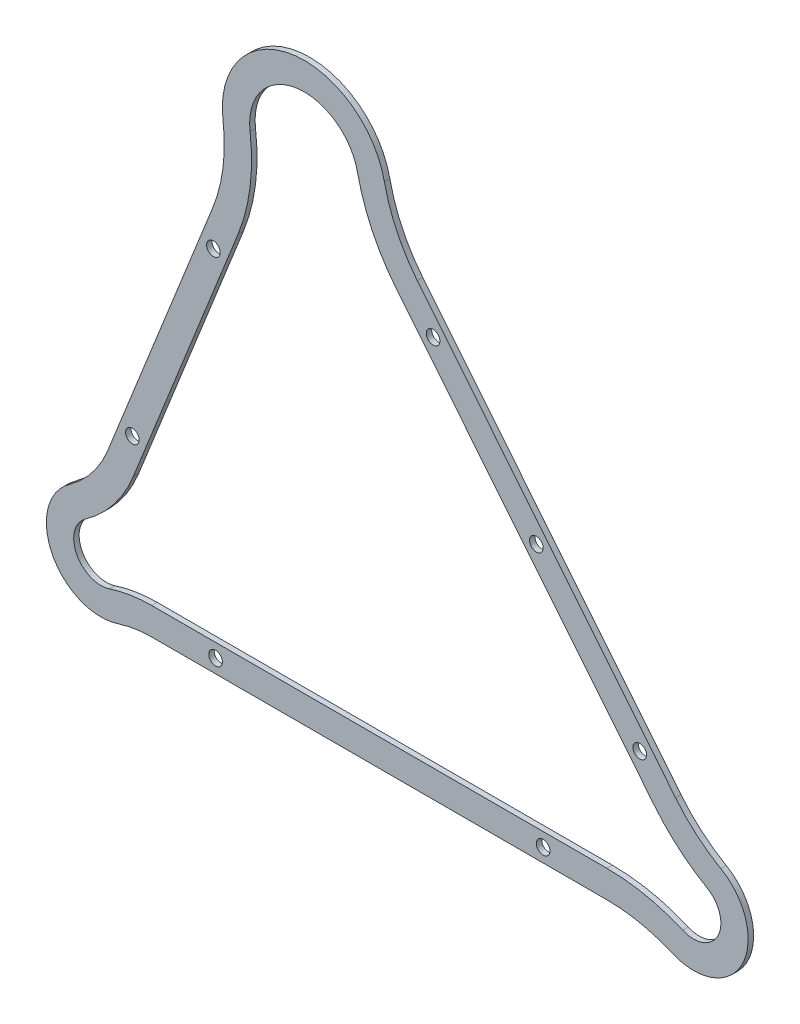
ISO-10303-21;
HEADER;
FILE_DESCRIPTION(('STEP AP214'),'2;1');
FILE_NAME('part.step','',(''),(''),'','','');
FILE_SCHEMA(('AUTOMOTIVE_DESIGN { 1 0 10303 214 1 1 1 1 }'));
ENDSEC;
DATA;
#1=APPLICATION_CONTEXT('core data for automotive mechanical design processes');
#2=APPLICATION_PROTOCOL_DEFINITION('international standard','automotive_design',2000,#1);
#3=PRODUCT_CONTEXT('',#1,'mechanical');
#4=PRODUCT('Part','Part','',(#3));
#5=PRODUCT_RELATED_PRODUCT_CATEGORY('part','',(#4));
#6=PRODUCT_DEFINITION_FORMATION('','',#4);
#7=PRODUCT_DEFINITION_CONTEXT('part definition',#1,'design');
#8=PRODUCT_DEFINITION('design','',#6,#7);
#9=PRODUCT_DEFINITION_SHAPE('','',#8);
#10=(LENGTH_UNIT() NAMED_UNIT(*) SI_UNIT(.MILLI.,.METRE.));
#11=(NAMED_UNIT(*) PLANE_ANGLE_UNIT() SI_UNIT($,.RADIAN.));
#12=(NAMED_UNIT(*) SI_UNIT($,.STERADIAN.) SOLID_ANGLE_UNIT());
#13=UNCERTAINTY_MEASURE_WITH_UNIT(LENGTH_MEASURE(1.E-05),#10,'distance_accuracy_value','');
#14=(GEOMETRIC_REPRESENTATION_CONTEXT(3) GLOBAL_UNCERTAINTY_ASSIGNED_CONTEXT((#13)) GLOBAL_UNIT_ASSIGNED_CONTEXT((#10,
#11,#12)) REPRESENTATION_CONTEXT('',''));
#15=CARTESIAN_POINT('',(0.,0.,0.));
#16=DIRECTION('',(0.,0.,1.));
#17=DIRECTION('',(1.,0.,0.));
#18=AXIS2_PLACEMENT_3D('',#15,#16,#17);
#19=CARTESIAN_POINT('',(65.3082975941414,-204.297699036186,15.24));
#20=DIRECTION('',(0.,0.,1.));
#21=DIRECTION('',(1.,0.,0.));
#22=AXIS2_PLACEMENT_3D('',#19,#20,#21);
#23=PLANE('',#22);
#24=CARTESIAN_POINT('',(35.6496370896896,-121.747699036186,15.24));
#25=DIRECTION('',(0.,0.,1.));
#26=DIRECTION('',(1.,0.,0.));
#27=AXIS2_PLACEMENT_3D('',#24,#25,#26);
#28=CIRCLE('',#27,3.175);
#29=CARTESIAN_POINT('',(38.8246370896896,-121.747699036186,15.24));
#30=VERTEX_POINT('',#29);
#31=EDGE_CURVE('E635',#30,#30,#28,.T.);
#32=ORIENTED_EDGE('',*,*,#31,.F.);
#33=EDGE_LOOP('',(#32));
#34=FACE_BOUND('',#33,.T.);
#35=CARTESIAN_POINT('',(32.5104068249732,-1.20887657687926,15.24));
#36=DIRECTION('',(0.,0.,1.));
#37=DIRECTION('',(1.,0.,0.));
#38=AXIS2_PLACEMENT_3D('',#35,#36,#37);
#39=CIRCLE('',#38,3.175);
#40=CARTESIAN_POINT('',(35.6854068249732,-1.20887657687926,15.24));
#41=VERTEX_POINT('',#40);
#42=EDGE_CURVE('E647',#41,#41,#39,.T.);
#43=ORIENTED_EDGE('',*,*,#42,.F.);
#44=EDGE_LOOP('',(#43));
#45=FACE_BOUND('',#44,.T.);
#46=CARTESIAN_POINT('',(-155.458523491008,-51.6238407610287,15.24));
#47=DIRECTION('',(0.,0.,1.));
#48=DIRECTION('',(1.,0.,0.));
#49=AXIS2_PLACEMENT_3D('',#46,#47,#48);
#50=CIRCLE('',#49,3.17499999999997);
#51=CARTESIAN_POINT('',(-152.283523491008,-51.6238407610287,15.24));
#52=VERTEX_POINT('',#51);
#53=EDGE_CURVE('E659',#52,#52,#50,.T.);
#54=ORIENTED_EDGE('',*,*,#53,.F.);
#55=EDGE_LOOP('',(#54));
#56=FACE_BOUND('',#55,.T.);
#57=DIRECTION('',(-0.629440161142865,0.777048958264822,0.));
#58=VECTOR('',#57,1.);
#59=CARTESIAN_POINT('',(87.36603751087,-79.0169252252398,15.24));
#60=LINE('',#59,#58);
#61=CARTESIAN_POINT('',(87.36603751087,-79.0169252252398,15.24));
#62=VERTEX_POINT('',#61);
#63=CARTESIAN_POINT('',(-32.7505847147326,69.2680142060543,15.24));
#64=VERTEX_POINT('',#63);
#65=EDGE_CURVE('E243',#62,#64,#60,.T.);
#66=ORIENTED_EDGE('',*,*,#65,.F.);
#67=CARTESIAN_POINT('',(156.445689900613,-23.0596948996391,15.24));
#68=DIRECTION('',(0.,0.,-1.));
#69=DIRECTION('',(1.,0.,0.));
#70=AXIS2_PLACEMENT_3D('',#67,#68,#69);
#71=CIRCLE('',#70,88.9);
#72=CARTESIAN_POINT('',(111.998112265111,-100.050751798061,15.24));
#73=VERTEX_POINT('',#72);
#74=EDGE_CURVE('E202',#73,#62,#71,.T.);
#75=ORIENTED_EDGE('',*,*,#74,.F.);
#76=CARTESIAN_POINT('',(105.648458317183,-111.049474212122,15.24));
#77=DIRECTION('',(0.,0.,1.));
#78=DIRECTION('',(1.,0.,0.));
#79=AXIS2_PLACEMENT_3D('',#76,#77,#78);
#80=CIRCLE('',#79,12.7);
#81=CARTESIAN_POINT('',(100.605938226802,-122.70550231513,15.24));
#82=VERTEX_POINT('',#81);
#83=EDGE_CURVE('E263',#82,#73,#80,.T.);
#84=ORIENTED_EDGE('',*,*,#83,.F.);
#85=CARTESIAN_POINT('',(65.3082975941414,-204.297699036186,15.24));
#86=DIRECTION('',(0.,0.,-1.));
#87=DIRECTION('',(1.,0.,0.));
#88=AXIS2_PLACEMENT_3D('',#85,#86,#87);
#89=CIRCLE('',#88,88.9);
#90=CARTESIAN_POINT('',(65.3082975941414,-115.397699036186,15.24));
#91=VERTEX_POINT('',#90);
#92=EDGE_CURVE('E261',#91,#82,#89,.T.);
#93=ORIENTED_EDGE('',*,*,#92,.F.);
#94=DIRECTION('',(1.,0.,0.));
#95=VECTOR('',#94,1.);
#96=CARTESIAN_POINT('',(-146.409023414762,-115.397699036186,15.24));
#97=LINE('',#96,#95);
#98=CARTESIAN_POINT('',(-146.409023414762,-115.397699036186,15.24));
#99=VERTEX_POINT('',#98);
#100=EDGE_CURVE('E259',#99,#91,#97,.T.);
#101=ORIENTED_EDGE('',*,*,#100,.F.);
#102=CARTESIAN_POINT('',(-146.409023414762,-178.897699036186,15.24));
#103=DIRECTION('',(0.,0.,-1.));
#104=DIRECTION('',(1.,0.,0.));
#105=AXIS2_PLACEMENT_3D('',#102,#103,#104);
#106=CIRCLE('',#105,63.5);
#107=CARTESIAN_POINT('',(-166.133198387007,-118.538715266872,15.24));
#108=VERTEX_POINT('',#107);
#109=EDGE_CURVE('E257',#108,#99,#106,.T.);
#110=ORIENTED_EDGE('',*,*,#109,.F.);
#111=CARTESIAN_POINT('',(-170.078033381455,-106.466918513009,15.24));
#112=DIRECTION('',(0.,0.,1.));
#113=DIRECTION('',(1.,0.,0.));
#114=AXIS2_PLACEMENT_3D('',#111,#112,#113);
#115=CIRCLE('',#114,12.7);
#116=CARTESIAN_POINT('',(-177.406596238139,-96.0947361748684,15.24));
#117=VERTEX_POINT('',#116);
#118=EDGE_CURVE('E255',#117,#108,#115,.T.);
#119=ORIENTED_EDGE('',*,*,#118,.F.);
#120=CARTESIAN_POINT('',(-214.049410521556,-44.2338244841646,15.24));
#121=DIRECTION('',(0.,0.,-1.));
#122=DIRECTION('',(1.,0.,0.));
#123=AXIS2_PLACEMENT_3D('',#120,#121,#122);
#124=CIRCLE('',#123,63.5);
#125=CARTESIAN_POINT('',(-155.082996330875,-67.7967614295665,15.24));
#126=VERTEX_POINT('',#125);
#127=EDGE_CURVE('E253',#126,#117,#124,.T.);
#128=ORIENTED_EDGE('',*,*,#127,.F.);
#129=DIRECTION('',(-0.371069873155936,-0.928604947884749,0.));
#130=VECTOR('',#129,1.);
#131=CARTESIAN_POINT('',(-106.340068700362,54.1827552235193,15.24));
#132=LINE('',#131,#130);
#133=CARTESIAN_POINT('',(-106.340068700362,54.1827552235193,15.24));
#134=VERTEX_POINT('',#133);
#135=EDGE_CURVE('E251',#134,#126,#132,.T.);
#136=ORIENTED_EDGE('',*,*,#135,.F.);
#137=CARTESIAN_POINT('',(-188.893048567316,87.170866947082,15.24));
#138=DIRECTION('',(0.,0.,-1.));
#139=DIRECTION('',(1.,0.,0.));
#140=AXIS2_PLACEMENT_3D('',#137,#138,#139);
#141=CIRCLE('',#140,88.9);
#142=CARTESIAN_POINT('',(-100.709960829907,98.4382107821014,15.24));
#143=VERTEX_POINT('',#142);
#144=EDGE_CURVE('E249',#143,#134,#141,.T.);
#145=ORIENTED_EDGE('',*,*,#144,.F.);
#146=CARTESIAN_POINT('',(-75.5147929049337,101.657451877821,15.24));
#147=DIRECTION('',(0.,0.,1.));
#148=DIRECTION('',(1.,0.,0.));
#149=AXIS2_PLACEMENT_3D('',#146,#147,#148);
#150=CIRCLE('',#149,25.4);
#151=CARTESIAN_POINT('',(-50.6606016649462,106.894739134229,15.24));
#152=VERTEX_POINT('',#151);
#153=EDGE_CURVE('E247',#152,#143,#150,.T.);
#154=ORIENTED_EDGE('',*,*,#153,.F.);
#155=CARTESIAN_POINT('',(36.3290676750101,125.225244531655,15.24));
#156=DIRECTION('',(0.,0.,-1.));
#157=DIRECTION('',(1.,0.,0.));
#158=AXIS2_PLACEMENT_3D('',#155,#156,#157);
#159=CIRCLE('',#158,88.9);
#160=EDGE_CURVE('E245',#64,#152,#159,.T.);
#161=ORIENTED_EDGE('',*,*,#160,.F.);
#162=EDGE_LOOP('',(#66,#75,#84,#93,#101,#110,#119,#128,#136,#145,#154,#161));
#163=FACE_BOUND('',#162,.T.);
#164=CARTESIAN_POINT('',(65.3082975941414,-204.297699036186,15.24));
#165=DIRECTION('',(0.,0.,-1.));
#166=DIRECTION('',(1.,0.,0.));
#167=AXIS2_PLACEMENT_3D('',#164,#165,#166);
#168=CIRCLE('',#167,76.2);
#169=CARTESIAN_POINT('',(65.3082975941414,-128.097699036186,15.24));
#170=VERTEX_POINT('',#169);
#171=CARTESIAN_POINT('',(95.5634181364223,-134.361530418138,15.24));
#172=VERTEX_POINT('',#171);
#173=EDGE_CURVE('E309',#170,#172,#168,.T.);
#174=ORIENTED_EDGE('',*,*,#173,.T.);
#175=CARTESIAN_POINT('',(105.648458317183,-111.049474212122,15.24));
#176=DIRECTION('',(0.,0.,1.));
#177=DIRECTION('',(1.,0.,0.));
#178=AXIS2_PLACEMENT_3D('',#175,#176,#177);
#179=CIRCLE('',#178,25.4);
#180=CARTESIAN_POINT('',(118.34776621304,-89.052029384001,15.24));
#181=VERTEX_POINT('',#180);
#182=EDGE_CURVE('E312',#172,#181,#179,.T.);
#183=ORIENTED_EDGE('',*,*,#182,.T.);
#184=CARTESIAN_POINT('',(156.445689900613,-23.0596948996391,15.24));
#185=DIRECTION('',(0.,0.,-1.));
#186=DIRECTION('',(1.,0.,0.));
#187=AXIS2_PLACEMENT_3D('',#184,#185,#186);
#188=CIRCLE('',#187,76.2);
#189=CARTESIAN_POINT('',(97.2345592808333,-71.0230351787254,15.24));
#190=VERTEX_POINT('',#189);
#191=EDGE_CURVE('E314',#181,#190,#188,.T.);
#192=ORIENTED_EDGE('',*,*,#191,.T.);
#193=DIRECTION('',(-0.629440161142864,0.777048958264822,0.));
#194=VECTOR('',#193,1.);
#195=CARTESIAN_POINT('',(97.2345592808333,-71.0230351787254,15.24));
#196=LINE('',#195,#194);
#197=CARTESIAN_POINT('',(-22.8820629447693,77.2619042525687,15.24));
#198=VERTEX_POINT('',#197);
#199=EDGE_CURVE('E316',#190,#198,#196,.T.);
#200=ORIENTED_EDGE('',*,*,#199,.T.);
#201=CARTESIAN_POINT('',(36.3290676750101,125.225244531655,15.24));
#202=DIRECTION('',(0.,0.,-1.));
#203=DIRECTION('',(1.,0.,0.));
#204=AXIS2_PLACEMENT_3D('',#201,#202,#203);
#205=CIRCLE('',#204,76.2);
#206=CARTESIAN_POINT('',(-38.2335060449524,109.513382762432,15.24));
#207=VERTEX_POINT('',#206);
#208=EDGE_CURVE('E318',#198,#207,#205,.T.);
#209=ORIENTED_EDGE('',*,*,#208,.T.);
#210=CARTESIAN_POINT('',(-75.5147929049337,101.657451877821,15.24));
#211=DIRECTION('',(0.,0.,1.));
#212=DIRECTION('',(1.,0.,0.));
#213=AXIS2_PLACEMENT_3D('',#210,#211,#212);
#214=CIRCLE('',#213,38.1);
#215=CARTESIAN_POINT('',(-113.307544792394,96.8285902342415,15.24));
#216=VERTEX_POINT('',#215);
#217=EDGE_CURVE('E320',#207,#216,#214,.T.);
#218=ORIENTED_EDGE('',*,*,#217,.T.);
#219=CARTESIAN_POINT('',(-188.893048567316,87.170866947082,15.24));
#220=DIRECTION('',(0.,0.,-1.));
#221=DIRECTION('',(1.,0.,0.));
#222=AXIS2_PLACEMENT_3D('',#219,#220,#221);
#223=CIRCLE('',#222,76.2);
#224=CARTESIAN_POINT('',(-118.133351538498,58.8953426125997,15.24));
#225=VERTEX_POINT('',#224);
#226=EDGE_CURVE('E322',#216,#225,#223,.T.);
#227=ORIENTED_EDGE('',*,*,#226,.T.);
#228=DIRECTION('',(-0.371069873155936,-0.928604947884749,0.));
#229=VECTOR('',#228,1.);
#230=CARTESIAN_POINT('',(-118.133351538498,58.8953426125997,15.24));
#231=LINE('',#230,#229);
#232=CARTESIAN_POINT('',(-166.876279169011,-63.0841740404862,15.24));
#233=VERTEX_POINT('',#232);
#234=EDGE_CURVE('E324',#225,#233,#231,.T.);
#235=ORIENTED_EDGE('',*,*,#234,.T.);
#236=CARTESIAN_POINT('',(-214.049410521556,-44.2338244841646,15.24));
#237=DIRECTION('',(0.,0.,-1.));
#238=DIRECTION('',(1.,0.,0.));
#239=AXIS2_PLACEMENT_3D('',#236,#237,#238);
#240=CIRCLE('',#239,50.8);
#241=CARTESIAN_POINT('',(-184.735159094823,-85.7225538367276,15.24));
#242=VERTEX_POINT('',#241);
#243=EDGE_CURVE('E326',#233,#242,#240,.T.);
#244=ORIENTED_EDGE('',*,*,#243,.T.);
#245=CARTESIAN_POINT('',(-170.078033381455,-106.466918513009,15.24));
#246=DIRECTION('',(0.,0.,1.));
#247=DIRECTION('',(1.,0.,0.));
#248=AXIS2_PLACEMENT_3D('',#245,#246,#247);
#249=CIRCLE('',#248,25.4);
#250=CARTESIAN_POINT('',(-162.188363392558,-130.610512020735,15.24));
#251=VERTEX_POINT('',#250);
#252=EDGE_CURVE('E328',#242,#251,#249,.T.);
#253=ORIENTED_EDGE('',*,*,#252,.T.);
#254=CARTESIAN_POINT('',(-146.409023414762,-178.897699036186,15.24));
#255=DIRECTION('',(0.,0.,-1.));
#256=DIRECTION('',(1.,0.,0.));
#257=AXIS2_PLACEMENT_3D('',#254,#255,#256);
#258=CIRCLE('',#257,50.8);
#259=CARTESIAN_POINT('',(-146.409023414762,-128.097699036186,15.24));
#260=VERTEX_POINT('',#259);
#261=EDGE_CURVE('E330',#251,#260,#258,.T.);
#262=ORIENTED_EDGE('',*,*,#261,.T.);
#263=DIRECTION('',(1.,0.,0.));
#264=VECTOR('',#263,1.);
#265=CARTESIAN_POINT('',(-146.409023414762,-128.097699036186,15.24));
#266=LINE('',#265,#264);
#267=EDGE_CURVE('E332',#260,#170,#266,.T.);
#268=ORIENTED_EDGE('',*,*,#267,.T.);
#269=EDGE_LOOP('',(#174,#183,#192,#200,#209,#218,#227,#235,#244,#253,#262,#268));
#270=FACE_BOUND('',#269,.T.);
#271=CARTESIAN_POINT('',(-117.757824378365,42.7224219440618,15.24));
#272=DIRECTION('',(0.,0.,1.));
#273=DIRECTION('',(1.,0.,0.));
#274=AXIS2_PLACEMENT_3D('',#271,#272,#273);
#275=CIRCLE('',#274,3.175);
#276=CARTESIAN_POINT('',(-114.582824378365,42.7224219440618,15.24));
#277=VERTEX_POINT('',#276);
#278=EDGE_CURVE('E210',#277,#277,#275,.T.);
#279=ORIENTED_EDGE('',*,*,#278,.F.);
#280=EDGE_LOOP('',(#279));
#281=FACE_BOUND('',#280,.T.);
#282=CARTESIAN_POINT('',(-15.5609679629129,58.1356235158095,15.24));
#283=DIRECTION('',(0.,0.,1.));
#284=DIRECTION('',(1.,0.,0.));
#285=AXIS2_PLACEMENT_3D('',#282,#283,#284);
#286=CIRCLE('',#285,3.17500000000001);
#287=CARTESIAN_POINT('',(-12.3859679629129,58.1356235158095,15.24));
#288=VERTEX_POINT('',#287);
#289=EDGE_CURVE('E653',#288,#288,#286,.T.);
#290=ORIENTED_EDGE('',*,*,#289,.F.);
#291=EDGE_LOOP('',(#290));
#292=FACE_BOUND('',#291,.T.);
#293=CARTESIAN_POINT('',(80.5817816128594,-60.553376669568,15.24));
#294=DIRECTION('',(0.,0.,1.));
#295=DIRECTION('',(1.,0.,0.));
#296=AXIS2_PLACEMENT_3D('',#293,#294,#295);
#297=CIRCLE('',#296,3.175);
#298=CARTESIAN_POINT('',(83.7567816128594,-60.553376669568,15.24));
#299=VERTEX_POINT('',#298);
#300=EDGE_CURVE('E641',#299,#299,#297,.T.);
#301=ORIENTED_EDGE('',*,*,#300,.F.);
#302=EDGE_LOOP('',(#301));
#303=FACE_BOUND('',#302,.T.);
#304=CARTESIAN_POINT('',(-116.75036291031,-121.747699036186,15.24));
#305=DIRECTION('',(0.,0.,1.));
#306=DIRECTION('',(1.,0.,0.));
#307=AXIS2_PLACEMENT_3D('',#304,#305,#306);
#308=CIRCLE('',#307,3.175);
#309=CARTESIAN_POINT('',(-113.57536291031,-121.747699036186,15.24));
#310=VERTEX_POINT('',#309);
#311=EDGE_CURVE('E624',#310,#310,#308,.T.);
#312=ORIENTED_EDGE('',*,*,#311,.F.);
#313=EDGE_LOOP('',(#312));
#314=FACE_BOUND('',#313,.T.);
#315=ADVANCED_FACE('F26',(#34,#45,#56,#163,#270,#281,#292,#303,#314),#23,.T.);
#316=CARTESIAN_POINT('',(65.3082975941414,-204.297699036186,12.7));
#317=DIRECTION('',(0.,0.,1.));
#318=DIRECTION('',(1.,0.,0.));
#319=AXIS2_PLACEMENT_3D('',#316,#317,#318);
#320=PLANE('',#319);
#321=CARTESIAN_POINT('',(35.6496370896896,-121.747699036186,12.7));
#322=DIRECTION('',(0.,0.,1.));
#323=DIRECTION('',(1.,0.,0.));
#324=AXIS2_PLACEMENT_3D('',#321,#322,#323);
#325=CIRCLE('',#324,3.175);
#326=CARTESIAN_POINT('',(38.8246370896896,-121.747699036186,12.7));
#327=VERTEX_POINT('',#326);
#328=EDGE_CURVE('E630',#327,#327,#325,.T.);
#329=ORIENTED_EDGE('',*,*,#328,.T.);
#330=EDGE_LOOP('',(#329));
#331=FACE_BOUND('',#330,.T.);
#332=CARTESIAN_POINT('',(32.5104068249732,-1.20887657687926,12.7));
#333=DIRECTION('',(0.,0.,1.));
#334=DIRECTION('',(1.,0.,0.));
#335=AXIS2_PLACEMENT_3D('',#332,#333,#334);
#336=CIRCLE('',#335,3.175);
#337=CARTESIAN_POINT('',(35.6854068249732,-1.20887657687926,12.7));
#338=VERTEX_POINT('',#337);
#339=EDGE_CURVE('E644',#338,#338,#336,.T.);
#340=ORIENTED_EDGE('',*,*,#339,.T.);
#341=EDGE_LOOP('',(#340));
#342=FACE_BOUND('',#341,.T.);
#343=CARTESIAN_POINT('',(-155.458523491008,-51.6238407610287,12.7));
#344=DIRECTION('',(0.,0.,1.));
#345=DIRECTION('',(1.,0.,0.));
#346=AXIS2_PLACEMENT_3D('',#343,#344,#345);
#347=CIRCLE('',#346,3.17499999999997);
#348=CARTESIAN_POINT('',(-152.283523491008,-51.6238407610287,12.7));
#349=VERTEX_POINT('',#348);
#350=EDGE_CURVE('E656',#349,#349,#347,.T.);
#351=ORIENTED_EDGE('',*,*,#350,.T.);
#352=EDGE_LOOP('',(#351));
#353=FACE_BOUND('',#352,.T.);
#354=CARTESIAN_POINT('',(156.445689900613,-23.0596948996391,12.7));
#355=DIRECTION('',(0.,0.,-1.));
#356=DIRECTION('',(1.,0.,0.));
#357=AXIS2_PLACEMENT_3D('',#354,#355,#356);
#358=CIRCLE('',#357,88.9);
#359=CARTESIAN_POINT('',(111.998112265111,-100.050751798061,12.7));
#360=VERTEX_POINT('',#359);
#361=CARTESIAN_POINT('',(87.36603751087,-79.0169252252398,12.7));
#362=VERTEX_POINT('',#361);
#363=EDGE_CURVE('E49',#360,#362,#358,.T.);
#364=ORIENTED_EDGE('',*,*,#363,.T.);
#365=DIRECTION('',(-0.629440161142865,0.777048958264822,0.));
#366=VECTOR('',#365,1.);
#367=CARTESIAN_POINT('',(87.36603751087,-79.0169252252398,12.7));
#368=LINE('',#367,#366);
#369=CARTESIAN_POINT('',(-32.7505847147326,69.2680142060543,12.7));
#370=VERTEX_POINT('',#369);
#371=EDGE_CURVE('E189',#362,#370,#368,.T.);
#372=ORIENTED_EDGE('',*,*,#371,.T.);
#373=CARTESIAN_POINT('',(36.3290676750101,125.225244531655,12.7));
#374=DIRECTION('',(0.,0.,-1.));
#375=DIRECTION('',(1.,0.,0.));
#376=AXIS2_PLACEMENT_3D('',#373,#374,#375);
#377=CIRCLE('',#376,88.9);
#378=CARTESIAN_POINT('',(-50.6606016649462,106.894739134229,12.7));
#379=VERTEX_POINT('',#378);
#380=EDGE_CURVE('E198',#370,#379,#377,.T.);
#381=ORIENTED_EDGE('',*,*,#380,.T.);
#382=CARTESIAN_POINT('',(-75.5147929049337,101.657451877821,12.7));
#383=DIRECTION('',(0.,0.,1.));
#384=DIRECTION('',(1.,0.,0.));
#385=AXIS2_PLACEMENT_3D('',#382,#383,#384);
#386=CIRCLE('',#385,25.4);
#387=CARTESIAN_POINT('',(-100.709960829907,98.4382107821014,12.7));
#388=VERTEX_POINT('',#387);
#389=EDGE_CURVE('E218',#379,#388,#386,.T.);
#390=ORIENTED_EDGE('',*,*,#389,.T.);
#391=CARTESIAN_POINT('',(-188.893048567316,87.170866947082,12.7));
#392=DIRECTION('',(0.,0.,-1.));
#393=DIRECTION('',(1.,0.,0.));
#394=AXIS2_PLACEMENT_3D('',#391,#392,#393);
#395=CIRCLE('',#394,88.9);
#396=CARTESIAN_POINT('',(-106.340068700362,54.1827552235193,12.7));
#397=VERTEX_POINT('',#396);
#398=EDGE_CURVE('E221',#388,#397,#395,.T.);
#399=ORIENTED_EDGE('',*,*,#398,.T.);
#400=DIRECTION('',(-0.371069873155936,-0.928604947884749,0.));
#401=VECTOR('',#400,1.);
#402=CARTESIAN_POINT('',(-106.340068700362,54.1827552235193,12.7));
#403=LINE('',#402,#401);
#404=CARTESIAN_POINT('',(-155.082996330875,-67.7967614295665,12.7));
#405=VERTEX_POINT('',#404);
#406=EDGE_CURVE('E224',#397,#405,#403,.T.);
#407=ORIENTED_EDGE('',*,*,#406,.T.);
#408=CARTESIAN_POINT('',(-214.049410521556,-44.2338244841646,12.7));
#409=DIRECTION('',(0.,0.,-1.));
#410=DIRECTION('',(1.,0.,0.));
#411=AXIS2_PLACEMENT_3D('',#408,#409,#410);
#412=CIRCLE('',#411,63.5);
#413=CARTESIAN_POINT('',(-177.406596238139,-96.0947361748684,12.7));
#414=VERTEX_POINT('',#413);
#415=EDGE_CURVE('E227',#405,#414,#412,.T.);
#416=ORIENTED_EDGE('',*,*,#415,.T.);
#417=CARTESIAN_POINT('',(-170.078033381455,-106.466918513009,12.7));
#418=DIRECTION('',(0.,0.,1.));
#419=DIRECTION('',(1.,0.,0.));
#420=AXIS2_PLACEMENT_3D('',#417,#418,#419);
#421=CIRCLE('',#420,12.7);
#422=CARTESIAN_POINT('',(-166.133198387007,-118.538715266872,12.7));
#423=VERTEX_POINT('',#422);
#424=EDGE_CURVE('E230',#414,#423,#421,.T.);
#425=ORIENTED_EDGE('',*,*,#424,.T.);
#426=CARTESIAN_POINT('',(-146.409023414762,-178.897699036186,12.7));
#427=DIRECTION('',(0.,0.,-1.));
#428=DIRECTION('',(1.,0.,0.));
#429=AXIS2_PLACEMENT_3D('',#426,#427,#428);
#430=CIRCLE('',#429,63.5);
#431=CARTESIAN_POINT('',(-146.409023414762,-115.397699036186,12.7));
#432=VERTEX_POINT('',#431);
#433=EDGE_CURVE('E233',#423,#432,#430,.T.);
#434=ORIENTED_EDGE('',*,*,#433,.T.);
#435=DIRECTION('',(1.,0.,0.));
#436=VECTOR('',#435,1.);
#437=CARTESIAN_POINT('',(-146.409023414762,-115.397699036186,12.7));
#438=LINE('',#437,#436);
#439=CARTESIAN_POINT('',(65.3082975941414,-115.397699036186,12.7));
#440=VERTEX_POINT('',#439);
#441=EDGE_CURVE('E236',#432,#440,#438,.T.);
#442=ORIENTED_EDGE('',*,*,#441,.T.);
#443=CARTESIAN_POINT('',(65.3082975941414,-204.297699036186,12.7));
#444=DIRECTION('',(0.,0.,-1.));
#445=DIRECTION('',(1.,0.,0.));
#446=AXIS2_PLACEMENT_3D('',#443,#444,#445);
#447=CIRCLE('',#446,88.9);
#448=CARTESIAN_POINT('',(100.605938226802,-122.70550231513,12.7));
#449=VERTEX_POINT('',#448);
#450=EDGE_CURVE('E239',#440,#449,#447,.T.);
#451=ORIENTED_EDGE('',*,*,#450,.T.);
#452=CARTESIAN_POINT('',(105.648458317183,-111.049474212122,12.7));
#453=DIRECTION('',(0.,0.,1.));
#454=DIRECTION('',(1.,0.,0.));
#455=AXIS2_PLACEMENT_3D('',#452,#453,#454);
#456=CIRCLE('',#455,12.7);
#457=EDGE_CURVE('E209',#449,#360,#456,.T.);
#458=ORIENTED_EDGE('',*,*,#457,.T.);
#459=EDGE_LOOP('',(#364,#372,#381,#390,#399,#407,#416,#425,#434,#442,#451,#458));
#460=FACE_BOUND('',#459,.T.);
#461=CARTESIAN_POINT('',(65.3082975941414,-204.297699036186,12.7));
#462=DIRECTION('',(0.,0.,-1.));
#463=DIRECTION('',(1.,0.,0.));
#464=AXIS2_PLACEMENT_3D('',#461,#462,#463);
#465=CIRCLE('',#464,76.2);
#466=CARTESIAN_POINT('',(65.3082975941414,-128.097699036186,12.7));
#467=VERTEX_POINT('',#466);
#468=CARTESIAN_POINT('',(95.5634181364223,-134.361530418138,12.7));
#469=VERTEX_POINT('',#468);
#470=EDGE_CURVE('E203',#467,#469,#465,.T.);
#471=ORIENTED_EDGE('',*,*,#470,.F.);
#472=DIRECTION('',(1.,0.,0.));
#473=VECTOR('',#472,1.);
#474=CARTESIAN_POINT('',(-146.409023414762,-128.097699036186,12.7));
#475=LINE('',#474,#473);
#476=CARTESIAN_POINT('',(-146.409023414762,-128.097699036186,12.7));
#477=VERTEX_POINT('',#476);
#478=EDGE_CURVE('E307',#477,#467,#475,.T.);
#479=ORIENTED_EDGE('',*,*,#478,.F.);
#480=CARTESIAN_POINT('',(-146.409023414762,-178.897699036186,12.7));
#481=DIRECTION('',(0.,0.,-1.));
#482=DIRECTION('',(1.,0.,0.));
#483=AXIS2_PLACEMENT_3D('',#480,#481,#482);
#484=CIRCLE('',#483,50.8);
#485=CARTESIAN_POINT('',(-162.188363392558,-130.610512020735,12.7));
#486=VERTEX_POINT('',#485);
#487=EDGE_CURVE('E305',#486,#477,#484,.T.);
#488=ORIENTED_EDGE('',*,*,#487,.F.);
#489=CARTESIAN_POINT('',(-170.078033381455,-106.466918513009,12.7));
#490=DIRECTION('',(0.,0.,1.));
#491=DIRECTION('',(1.,0.,0.));
#492=AXIS2_PLACEMENT_3D('',#489,#490,#491);
#493=CIRCLE('',#492,25.4);
#494=CARTESIAN_POINT('',(-184.735159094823,-85.7225538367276,12.7));
#495=VERTEX_POINT('',#494);
#496=EDGE_CURVE('E303',#495,#486,#493,.T.);
#497=ORIENTED_EDGE('',*,*,#496,.F.);
#498=CARTESIAN_POINT('',(-214.049410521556,-44.2338244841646,12.7));
#499=DIRECTION('',(0.,0.,-1.));
#500=DIRECTION('',(1.,0.,0.));
#501=AXIS2_PLACEMENT_3D('',#498,#499,#500);
#502=CIRCLE('',#501,50.8);
#503=CARTESIAN_POINT('',(-166.876279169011,-63.0841740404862,12.7));
#504=VERTEX_POINT('',#503);
#505=EDGE_CURVE('E301',#504,#495,#502,.T.);
#506=ORIENTED_EDGE('',*,*,#505,.F.);
#507=DIRECTION('',(-0.371069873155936,-0.928604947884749,0.));
#508=VECTOR('',#507,1.);
#509=CARTESIAN_POINT('',(-118.133351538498,58.8953426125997,12.7));
#510=LINE('',#509,#508);
#511=CARTESIAN_POINT('',(-118.133351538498,58.8953426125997,12.7));
#512=VERTEX_POINT('',#511);
#513=EDGE_CURVE('E299',#512,#504,#510,.T.);
#514=ORIENTED_EDGE('',*,*,#513,.F.);
#515=CARTESIAN_POINT('',(-188.893048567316,87.170866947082,12.7));
#516=DIRECTION('',(0.,0.,-1.));
#517=DIRECTION('',(1.,0.,0.));
#518=AXIS2_PLACEMENT_3D('',#515,#516,#517);
#519=CIRCLE('',#518,76.2);
#520=CARTESIAN_POINT('',(-113.307544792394,96.8285902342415,12.7));
#521=VERTEX_POINT('',#520);
#522=EDGE_CURVE('E297',#521,#512,#519,.T.);
#523=ORIENTED_EDGE('',*,*,#522,.F.);
#524=CARTESIAN_POINT('',(-75.5147929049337,101.657451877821,12.7));
#525=DIRECTION('',(0.,0.,1.));
#526=DIRECTION('',(1.,0.,0.));
#527=AXIS2_PLACEMENT_3D('',#524,#525,#526);
#528=CIRCLE('',#527,38.1);
#529=CARTESIAN_POINT('',(-38.2335060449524,109.513382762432,12.7));
#530=VERTEX_POINT('',#529);
#531=EDGE_CURVE('E295',#530,#521,#528,.T.);
#532=ORIENTED_EDGE('',*,*,#531,.F.);
#533=CARTESIAN_POINT('',(36.3290676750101,125.225244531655,12.7));
#534=DIRECTION('',(0.,0.,-1.));
#535=DIRECTION('',(1.,0.,0.));
#536=AXIS2_PLACEMENT_3D('',#533,#534,#535);
#537=CIRCLE('',#536,76.2);
#538=CARTESIAN_POINT('',(-22.8820629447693,77.2619042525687,12.7));
#539=VERTEX_POINT('',#538);
#540=EDGE_CURVE('E293',#539,#530,#537,.T.);
#541=ORIENTED_EDGE('',*,*,#540,.F.);
#542=DIRECTION('',(-0.629440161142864,0.777048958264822,0.));
#543=VECTOR('',#542,1.);
#544=CARTESIAN_POINT('',(97.2345592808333,-71.0230351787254,12.7));
#545=LINE('',#544,#543);
#546=CARTESIAN_POINT('',(97.2345592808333,-71.0230351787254,12.7));
#547=VERTEX_POINT('',#546);
#548=EDGE_CURVE('E291',#547,#539,#545,.T.);
#549=ORIENTED_EDGE('',*,*,#548,.F.);
#550=CARTESIAN_POINT('',(156.445689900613,-23.0596948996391,12.7));
#551=DIRECTION('',(0.,0.,-1.));
#552=DIRECTION('',(1.,0.,0.));
#553=AXIS2_PLACEMENT_3D('',#550,#551,#552);
#554=CIRCLE('',#553,76.2);
#555=CARTESIAN_POINT('',(118.34776621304,-89.052029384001,12.7));
#556=VERTEX_POINT('',#555);
#557=EDGE_CURVE('E289',#556,#547,#554,.T.);
#558=ORIENTED_EDGE('',*,*,#557,.F.);
#559=CARTESIAN_POINT('',(105.648458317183,-111.049474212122,12.7));
#560=DIRECTION('',(0.,0.,1.));
#561=DIRECTION('',(1.,0.,0.));
#562=AXIS2_PLACEMENT_3D('',#559,#560,#561);
#563=CIRCLE('',#562,25.4);
#564=EDGE_CURVE('E287',#469,#556,#563,.T.);
#565=ORIENTED_EDGE('',*,*,#564,.F.);
#566=EDGE_LOOP('',(#471,#479,#488,#497,#506,#514,#523,#532,#541,#549,#558,#565));
#567=FACE_BOUND('',#566,.T.);
#568=CARTESIAN_POINT('',(-117.757824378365,42.7224219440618,12.7));
#569=DIRECTION('',(0.,0.,1.));
#570=DIRECTION('',(1.,0.,0.));
#571=AXIS2_PLACEMENT_3D('',#568,#569,#570);
#572=CIRCLE('',#571,3.175);
#573=CARTESIAN_POINT('',(-114.582824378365,42.7224219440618,12.7));
#574=VERTEX_POINT('',#573);
#575=EDGE_CURVE('E213',#574,#574,#572,.T.);
#576=ORIENTED_EDGE('',*,*,#575,.T.);
#577=EDGE_LOOP('',(#576));
#578=FACE_BOUND('',#577,.T.);
#579=CARTESIAN_POINT('',(-15.5609679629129,58.1356235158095,12.7));
#580=DIRECTION('',(0.,0.,1.));
#581=DIRECTION('',(1.,0.,0.));
#582=AXIS2_PLACEMENT_3D('',#579,#580,#581);
#583=CIRCLE('',#582,3.17500000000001);
#584=CARTESIAN_POINT('',(-12.3859679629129,58.1356235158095,12.7));
#585=VERTEX_POINT('',#584);
#586=EDGE_CURVE('E650',#585,#585,#583,.T.);
#587=ORIENTED_EDGE('',*,*,#586,.T.);
#588=EDGE_LOOP('',(#587));
#589=FACE_BOUND('',#588,.T.);
#590=CARTESIAN_POINT('',(80.5817816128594,-60.553376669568,12.7));
#591=DIRECTION('',(0.,0.,1.));
#592=DIRECTION('',(1.,0.,0.));
#593=AXIS2_PLACEMENT_3D('',#590,#591,#592);
#594=CIRCLE('',#593,3.175);
#595=CARTESIAN_POINT('',(83.7567816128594,-60.553376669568,12.7));
#596=VERTEX_POINT('',#595);
#597=EDGE_CURVE('E638',#596,#596,#594,.T.);
#598=ORIENTED_EDGE('',*,*,#597,.T.);
#599=EDGE_LOOP('',(#598));
#600=FACE_BOUND('',#599,.T.);
#601=CARTESIAN_POINT('',(-116.75036291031,-121.747699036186,12.7));
#602=DIRECTION('',(0.,0.,1.));
#603=DIRECTION('',(1.,0.,0.));
#604=AXIS2_PLACEMENT_3D('',#601,#602,#603);
#605=CIRCLE('',#604,3.175);
#606=CARTESIAN_POINT('',(-113.57536291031,-121.747699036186,12.7));
#607=VERTEX_POINT('',#606);
#608=EDGE_CURVE('E627',#607,#607,#605,.T.);
#609=ORIENTED_EDGE('',*,*,#608,.T.);
#610=EDGE_LOOP('',(#609));
#611=FACE_BOUND('',#610,.T.);
#612=ADVANCED_FACE('F206',(#331,#342,#353,#460,#567,#578,#589,#600,#611),#320,.F.);
#613=CARTESIAN_POINT('',(65.3082975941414,-204.297699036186,15.24));
#614=DIRECTION('',(0.,0.,-1.));
#615=DIRECTION('',(-1.,0.,0.));
#616=AXIS2_PLACEMENT_3D('',#613,#614,#615);
#617=CYLINDRICAL_SURFACE('',#616,76.2);
#618=ORIENTED_EDGE('',*,*,#470,.T.);
#619=DIRECTION('',(0.,0.,-1.));
#620=VECTOR('',#619,1.);
#621=CARTESIAN_POINT('',(95.5634181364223,-134.361530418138,15.24));
#622=LINE('',#621,#620);
#623=EDGE_CURVE('E11',#172,#469,#622,.T.);
#624=ORIENTED_EDGE('',*,*,#623,.F.);
#625=ORIENTED_EDGE('',*,*,#173,.F.);
#626=DIRECTION('',(0.,0.,-1.));
#627=VECTOR('',#626,1.);
#628=CARTESIAN_POINT('',(65.3082975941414,-128.097699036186,15.24));
#629=LINE('',#628,#627);
#630=EDGE_CURVE('E334',#170,#467,#629,.T.);
#631=ORIENTED_EDGE('',*,*,#630,.T.);
#632=EDGE_LOOP('',(#618,#624,#625,#631));
#633=FACE_BOUND('',#632,.T.);
#634=ADVANCED_FACE('F28',(#633),#617,.F.);
#635=CARTESIAN_POINT('',(105.648458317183,-111.049474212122,15.24));
#636=DIRECTION('',(0.,0.,-1.));
#637=DIRECTION('',(-1.,0.,0.));
#638=AXIS2_PLACEMENT_3D('',#635,#636,#637);
#639=CYLINDRICAL_SURFACE('',#638,25.4);
#640=ORIENTED_EDGE('',*,*,#564,.T.);
#641=DIRECTION('',(0.,0.,-1.));
#642=VECTOR('',#641,1.);
#643=CARTESIAN_POINT('',(118.34776621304,-89.052029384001,15.24));
#644=LINE('',#643,#642);
#645=EDGE_CURVE('E34',#181,#556,#644,.T.);
#646=ORIENTED_EDGE('',*,*,#645,.F.);
#647=ORIENTED_EDGE('',*,*,#182,.F.);
#648=ORIENTED_EDGE('',*,*,#623,.T.);
#649=EDGE_LOOP('',(#640,#646,#647,#648));
#650=FACE_BOUND('',#649,.T.);
#651=ADVANCED_FACE('F390',(#650),#639,.T.);
#652=CARTESIAN_POINT('',(156.445689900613,-23.0596948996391,15.24));
#653=DIRECTION('',(0.,0.,-1.));
#654=DIRECTION('',(-1.,0.,0.));
#655=AXIS2_PLACEMENT_3D('',#652,#653,#654);
#656=CYLINDRICAL_SURFACE('',#655,76.2);
#657=ORIENTED_EDGE('',*,*,#557,.T.);
#658=DIRECTION('',(0.,0.,-1.));
#659=VECTOR('',#658,1.);
#660=CARTESIAN_POINT('',(97.2345592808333,-71.0230351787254,15.24));
#661=LINE('',#660,#659);
#662=EDGE_CURVE('E361',#190,#547,#661,.T.);
#663=ORIENTED_EDGE('',*,*,#662,.F.);
#664=ORIENTED_EDGE('',*,*,#191,.F.);
#665=ORIENTED_EDGE('',*,*,#645,.T.);
#666=EDGE_LOOP('',(#657,#663,#664,#665));
#667=FACE_BOUND('',#666,.T.);
#668=ADVANCED_FACE('F368',(#667),#656,.F.);
#669=CARTESIAN_POINT('',(97.2345592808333,-71.0230351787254,15.24));
#670=DIRECTION('',(-0.777048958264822,-0.629440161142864,0.));
#671=DIRECTION('',(0.629440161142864,-0.777048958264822,0.));
#672=AXIS2_PLACEMENT_3D('',#669,#670,#671);
#673=PLANE('',#672);
#674=ORIENTED_EDGE('',*,*,#548,.T.);
#675=DIRECTION('',(0.,0.,-1.));
#676=VECTOR('',#675,1.);
#677=CARTESIAN_POINT('',(-22.8820629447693,77.2619042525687,15.24));
#678=LINE('',#677,#676);
#679=EDGE_CURVE('E358',#198,#539,#678,.T.);
#680=ORIENTED_EDGE('',*,*,#679,.F.);
#681=ORIENTED_EDGE('',*,*,#199,.F.);
#682=ORIENTED_EDGE('',*,*,#662,.T.);
#683=EDGE_LOOP('',(#674,#680,#681,#682));
#684=FACE_BOUND('',#683,.T.);
#685=ADVANCED_FACE('F378',(#684),#673,.F.);
#686=CARTESIAN_POINT('',(36.3290676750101,125.225244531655,15.24));
#687=DIRECTION('',(0.,0.,-1.));
#688=DIRECTION('',(-1.,0.,0.));
#689=AXIS2_PLACEMENT_3D('',#686,#687,#688);
#690=CYLINDRICAL_SURFACE('',#689,76.2);
#691=ORIENTED_EDGE('',*,*,#540,.T.);
#692=DIRECTION('',(0.,0.,-1.));
#693=VECTOR('',#692,1.);
#694=CARTESIAN_POINT('',(-38.2335060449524,109.513382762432,15.24));
#695=LINE('',#694,#693);
#696=EDGE_CURVE('E355',#207,#530,#695,.T.);
#697=ORIENTED_EDGE('',*,*,#696,.F.);
#698=ORIENTED_EDGE('',*,*,#208,.F.);
#699=ORIENTED_EDGE('',*,*,#679,.T.);
#700=EDGE_LOOP('',(#691,#697,#698,#699));
#701=FACE_BOUND('',#700,.T.);
#702=ADVANCED_FACE('F382',(#701),#690,.F.);
#703=CARTESIAN_POINT('',(-75.5147929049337,101.657451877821,15.24));
#704=DIRECTION('',(0.,0.,-1.));
#705=DIRECTION('',(-1.,0.,0.));
#706=AXIS2_PLACEMENT_3D('',#703,#704,#705);
#707=CYLINDRICAL_SURFACE('',#706,38.1);
#708=ORIENTED_EDGE('',*,*,#531,.T.);
#709=DIRECTION('',(0.,0.,-1.));
#710=VECTOR('',#709,1.);
#711=CARTESIAN_POINT('',(-113.307544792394,96.8285902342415,15.24));
#712=LINE('',#711,#710);
#713=EDGE_CURVE('E352',#216,#521,#712,.T.);
#714=ORIENTED_EDGE('',*,*,#713,.F.);
#715=ORIENTED_EDGE('',*,*,#217,.F.);
#716=ORIENTED_EDGE('',*,*,#696,.T.);
#717=EDGE_LOOP('',(#708,#714,#715,#716));
#718=FACE_BOUND('',#717,.T.);
#719=ADVANCED_FACE('F423',(#718),#707,.T.);
#720=CARTESIAN_POINT('',(-188.893048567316,87.170866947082,15.24));
#721=DIRECTION('',(0.,0.,-1.));
#722=DIRECTION('',(-1.,0.,0.));
#723=AXIS2_PLACEMENT_3D('',#720,#721,#722);
#724=CYLINDRICAL_SURFACE('',#723,76.2);
#725=ORIENTED_EDGE('',*,*,#522,.T.);
#726=DIRECTION('',(0.,0.,-1.));
#727=VECTOR('',#726,1.);
#728=CARTESIAN_POINT('',(-118.133351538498,58.8953426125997,15.24));
#729=LINE('',#728,#727);
#730=EDGE_CURVE('E349',#225,#512,#729,.T.);
#731=ORIENTED_EDGE('',*,*,#730,.F.);
#732=ORIENTED_EDGE('',*,*,#226,.F.);
#733=ORIENTED_EDGE('',*,*,#713,.T.);
#734=EDGE_LOOP('',(#725,#731,#732,#733));
#735=FACE_BOUND('',#734,.T.);
#736=ADVANCED_FACE('F421',(#735),#724,.F.);
#737=CARTESIAN_POINT('',(-118.133351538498,58.8953426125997,15.24));
#738=DIRECTION('',(0.928604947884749,-0.371069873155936,0.));
#739=DIRECTION('',(0.371069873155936,0.928604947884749,0.));
#740=AXIS2_PLACEMENT_3D('',#737,#738,#739);
#741=PLANE('',#740);
#742=ORIENTED_EDGE('',*,*,#513,.T.);
#743=DIRECTION('',(0.,0.,-1.));
#744=VECTOR('',#743,1.);
#745=CARTESIAN_POINT('',(-166.876279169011,-63.0841740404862,15.24));
#746=LINE('',#745,#744);
#747=EDGE_CURVE('E346',#233,#504,#746,.T.);
#748=ORIENTED_EDGE('',*,*,#747,.F.);
#749=ORIENTED_EDGE('',*,*,#234,.F.);
#750=ORIENTED_EDGE('',*,*,#730,.T.);
#751=EDGE_LOOP('',(#742,#748,#749,#750));
#752=FACE_BOUND('',#751,.T.);
#753=ADVANCED_FACE('F417',(#752),#741,.F.);
#754=CARTESIAN_POINT('',(-214.049410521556,-44.2338244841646,15.24));
#755=DIRECTION('',(0.,0.,-1.));
#756=DIRECTION('',(-1.,0.,0.));
#757=AXIS2_PLACEMENT_3D('',#754,#755,#756);
#758=CYLINDRICAL_SURFACE('',#757,50.8);
#759=ORIENTED_EDGE('',*,*,#505,.T.);
#760=DIRECTION('',(0.,0.,-1.));
#761=VECTOR('',#760,1.);
#762=CARTESIAN_POINT('',(-184.735159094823,-85.7225538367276,15.24));
#763=LINE('',#762,#761);
#764=EDGE_CURVE('E343',#242,#495,#763,.T.);
#765=ORIENTED_EDGE('',*,*,#764,.F.);
#766=ORIENTED_EDGE('',*,*,#243,.F.);
#767=ORIENTED_EDGE('',*,*,#747,.T.);
#768=EDGE_LOOP('',(#759,#765,#766,#767));
#769=FACE_BOUND('',#768,.T.);
#770=ADVANCED_FACE('F412',(#769),#758,.F.);
#771=CARTESIAN_POINT('',(-170.078033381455,-106.466918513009,15.24));
#772=DIRECTION('',(0.,0.,-1.));
#773=DIRECTION('',(-1.,0.,0.));
#774=AXIS2_PLACEMENT_3D('',#771,#772,#773);
#775=CYLINDRICAL_SURFACE('',#774,25.4);
#776=ORIENTED_EDGE('',*,*,#496,.T.);
#777=DIRECTION('',(0.,0.,-1.));
#778=VECTOR('',#777,1.);
#779=CARTESIAN_POINT('',(-162.188363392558,-130.610512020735,15.24));
#780=LINE('',#779,#778);
#781=EDGE_CURVE('E340',#251,#486,#780,.T.);
#782=ORIENTED_EDGE('',*,*,#781,.F.);
#783=ORIENTED_EDGE('',*,*,#252,.F.);
#784=ORIENTED_EDGE('',*,*,#764,.T.);
#785=EDGE_LOOP('',(#776,#782,#783,#784));
#786=FACE_BOUND('',#785,.T.);
#787=ADVANCED_FACE('F406',(#786),#775,.T.);
#788=CARTESIAN_POINT('',(-146.409023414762,-178.897699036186,15.24));
#789=DIRECTION('',(0.,0.,-1.));
#790=DIRECTION('',(-1.,0.,0.));
#791=AXIS2_PLACEMENT_3D('',#788,#789,#790);
#792=CYLINDRICAL_SURFACE('',#791,50.8);
#793=ORIENTED_EDGE('',*,*,#487,.T.);
#794=DIRECTION('',(0.,0.,-1.));
#795=VECTOR('',#794,1.);
#796=CARTESIAN_POINT('',(-146.409023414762,-128.097699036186,15.24));
#797=LINE('',#796,#795);
#798=EDGE_CURVE('E337',#260,#477,#797,.T.);
#799=ORIENTED_EDGE('',*,*,#798,.F.);
#800=ORIENTED_EDGE('',*,*,#261,.F.);
#801=ORIENTED_EDGE('',*,*,#781,.T.);
#802=EDGE_LOOP('',(#793,#799,#800,#801));
#803=FACE_BOUND('',#802,.T.);
#804=ADVANCED_FACE('F402',(#803),#792,.F.);
#805=CARTESIAN_POINT('',(-146.409023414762,-128.097699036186,15.24));
#806=DIRECTION('',(0.,1.,0.));
#807=DIRECTION('',(-1.,0.,0.));
#808=AXIS2_PLACEMENT_3D('',#805,#806,#807);
#809=PLANE('',#808);
#810=ORIENTED_EDGE('',*,*,#478,.T.);
#811=ORIENTED_EDGE('',*,*,#630,.F.);
#812=ORIENTED_EDGE('',*,*,#267,.F.);
#813=ORIENTED_EDGE('',*,*,#798,.T.);
#814=EDGE_LOOP('',(#810,#811,#812,#813));
#815=FACE_BOUND('',#814,.T.);
#816=ADVANCED_FACE('F397',(#815),#809,.F.);
#817=CARTESIAN_POINT('',(156.445689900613,-23.0596948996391,15.24));
#818=DIRECTION('',(0.,0.,-1.));
#819=DIRECTION('',(-1.,0.,0.));
#820=AXIS2_PLACEMENT_3D('',#817,#818,#819);
#821=CYLINDRICAL_SURFACE('',#820,88.9);
#822=ORIENTED_EDGE('',*,*,#363,.F.);
#823=DIRECTION('',(0.,0.,-1.));
#824=VECTOR('',#823,1.);
#825=CARTESIAN_POINT('',(111.998112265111,-100.050751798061,15.24));
#826=LINE('',#825,#824);
#827=EDGE_CURVE('E265',#73,#360,#826,.T.);
#828=ORIENTED_EDGE('',*,*,#827,.F.);
#829=ORIENTED_EDGE('',*,*,#74,.T.);
#830=DIRECTION('',(0.,0.,-1.));
#831=VECTOR('',#830,1.);
#832=CARTESIAN_POINT('',(87.36603751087,-79.0169252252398,15.24));
#833=LINE('',#832,#831);
#834=EDGE_CURVE('E191',#62,#362,#833,.T.);
#835=ORIENTED_EDGE('',*,*,#834,.T.);
#836=EDGE_LOOP('',(#822,#828,#829,#835));
#837=FACE_BOUND('',#836,.T.);
#838=ADVANCED_FACE('F200',(#837),#821,.T.);
#839=CARTESIAN_POINT('',(87.36603751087,-79.0169252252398,15.24));
#840=DIRECTION('',(-0.777048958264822,-0.629440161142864,0.));
#841=DIRECTION('',(0.629440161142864,-0.777048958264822,0.));
#842=AXIS2_PLACEMENT_3D('',#839,#840,#841);
#843=PLANE('',#842);
#844=ORIENTED_EDGE('',*,*,#371,.F.);
#845=ORIENTED_EDGE('',*,*,#834,.F.);
#846=ORIENTED_EDGE('',*,*,#65,.T.);
#847=DIRECTION('',(0.,0.,-1.));
#848=VECTOR('',#847,1.);
#849=CARTESIAN_POINT('',(-32.7505847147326,69.2680142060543,15.24));
#850=LINE('',#849,#848);
#851=EDGE_CURVE('E194',#64,#370,#850,.T.);
#852=ORIENTED_EDGE('',*,*,#851,.T.);
#853=EDGE_LOOP('',(#844,#845,#846,#852));
#854=FACE_BOUND('',#853,.T.);
#855=ADVANCED_FACE('F190',(#854),#843,.T.);
#856=CARTESIAN_POINT('',(36.3290676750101,125.225244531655,15.24));
#857=DIRECTION('',(0.,0.,-1.));
#858=DIRECTION('',(-1.,0.,0.));
#859=AXIS2_PLACEMENT_3D('',#856,#857,#858);
#860=CYLINDRICAL_SURFACE('',#859,88.9);
#861=ORIENTED_EDGE('',*,*,#380,.F.);
#862=ORIENTED_EDGE('',*,*,#851,.F.);
#863=ORIENTED_EDGE('',*,*,#160,.T.);
#864=DIRECTION('',(0.,0.,-1.));
#865=VECTOR('',#864,1.);
#866=CARTESIAN_POINT('',(-50.6606016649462,106.894739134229,15.24));
#867=LINE('',#866,#865);
#868=EDGE_CURVE('E282',#152,#379,#867,.T.);
#869=ORIENTED_EDGE('',*,*,#868,.T.);
#870=EDGE_LOOP('',(#861,#862,#863,#869));
#871=FACE_BOUND('',#870,.T.);
#872=ADVANCED_FACE('F484',(#871),#860,.T.);
#873=CARTESIAN_POINT('',(-75.5147929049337,101.657451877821,15.24));
#874=DIRECTION('',(0.,0.,-1.));
#875=DIRECTION('',(-1.,0.,0.));
#876=AXIS2_PLACEMENT_3D('',#873,#874,#875);
#877=CYLINDRICAL_SURFACE('',#876,25.4);
#878=ORIENTED_EDGE('',*,*,#389,.F.);
#879=ORIENTED_EDGE('',*,*,#868,.F.);
#880=ORIENTED_EDGE('',*,*,#153,.T.);
#881=DIRECTION('',(0.,0.,-1.));
#882=VECTOR('',#881,1.);
#883=CARTESIAN_POINT('',(-100.709960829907,98.4382107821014,15.24));
#884=LINE('',#883,#882);
#885=EDGE_CURVE('E280',#143,#388,#884,.T.);
#886=ORIENTED_EDGE('',*,*,#885,.T.);
#887=EDGE_LOOP('',(#878,#879,#880,#886));
#888=FACE_BOUND('',#887,.T.);
#889=ADVANCED_FACE('F491',(#888),#877,.F.);
#890=CARTESIAN_POINT('',(-188.893048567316,87.170866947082,15.24));
#891=DIRECTION('',(0.,0.,-1.));
#892=DIRECTION('',(-1.,0.,0.));
#893=AXIS2_PLACEMENT_3D('',#890,#891,#892);
#894=CYLINDRICAL_SURFACE('',#893,88.9);
#895=ORIENTED_EDGE('',*,*,#398,.F.);
#896=ORIENTED_EDGE('',*,*,#885,.F.);
#897=ORIENTED_EDGE('',*,*,#144,.T.);
#898=DIRECTION('',(0.,0.,-1.));
#899=VECTOR('',#898,1.);
#900=CARTESIAN_POINT('',(-106.340068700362,54.1827552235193,15.24));
#901=LINE('',#900,#899);
#902=EDGE_CURVE('E278',#134,#397,#901,.T.);
#903=ORIENTED_EDGE('',*,*,#902,.T.);
#904=EDGE_LOOP('',(#895,#896,#897,#903));
#905=FACE_BOUND('',#904,.T.);
#906=ADVANCED_FACE('F499',(#905),#894,.T.);
#907=CARTESIAN_POINT('',(-106.340068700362,54.1827552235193,15.24));
#908=DIRECTION('',(0.928604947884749,-0.371069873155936,0.));
#909=DIRECTION('',(0.371069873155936,0.928604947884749,0.));
#910=AXIS2_PLACEMENT_3D('',#907,#908,#909);
#911=PLANE('',#910);
#912=ORIENTED_EDGE('',*,*,#406,.F.);
#913=ORIENTED_EDGE('',*,*,#902,.F.);
#914=ORIENTED_EDGE('',*,*,#135,.T.);
#915=DIRECTION('',(0.,0.,-1.));
#916=VECTOR('',#915,1.);
#917=CARTESIAN_POINT('',(-155.082996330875,-67.7967614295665,15.24));
#918=LINE('',#917,#916);
#919=EDGE_CURVE('E276',#126,#405,#918,.T.);
#920=ORIENTED_EDGE('',*,*,#919,.T.);
#921=EDGE_LOOP('',(#912,#913,#914,#920));
#922=FACE_BOUND('',#921,.T.);
#923=ADVANCED_FACE('F507',(#922),#911,.T.);
#924=CARTESIAN_POINT('',(-214.049410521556,-44.2338244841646,15.24));
#925=DIRECTION('',(0.,0.,-1.));
#926=DIRECTION('',(-1.,0.,0.));
#927=AXIS2_PLACEMENT_3D('',#924,#925,#926);
#928=CYLINDRICAL_SURFACE('',#927,63.5);
#929=ORIENTED_EDGE('',*,*,#415,.F.);
#930=ORIENTED_EDGE('',*,*,#919,.F.);
#931=ORIENTED_EDGE('',*,*,#127,.T.);
#932=DIRECTION('',(0.,0.,-1.));
#933=VECTOR('',#932,1.);
#934=CARTESIAN_POINT('',(-177.406596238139,-96.0947361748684,15.24));
#935=LINE('',#934,#933);
#936=EDGE_CURVE('E274',#117,#414,#935,.T.);
#937=ORIENTED_EDGE('',*,*,#936,.T.);
#938=EDGE_LOOP('',(#929,#930,#931,#937));
#939=FACE_BOUND('',#938,.T.);
#940=ADVANCED_FACE('F515',(#939),#928,.T.);
#941=CARTESIAN_POINT('',(-170.078033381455,-106.466918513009,15.24));
#942=DIRECTION('',(0.,0.,-1.));
#943=DIRECTION('',(-1.,0.,0.));
#944=AXIS2_PLACEMENT_3D('',#941,#942,#943);
#945=CYLINDRICAL_SURFACE('',#944,12.7);
#946=ORIENTED_EDGE('',*,*,#424,.F.);
#947=ORIENTED_EDGE('',*,*,#936,.F.);
#948=ORIENTED_EDGE('',*,*,#118,.T.);
#949=DIRECTION('',(0.,0.,-1.));
#950=VECTOR('',#949,1.);
#951=CARTESIAN_POINT('',(-166.133198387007,-118.538715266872,15.24));
#952=LINE('',#951,#950);
#953=EDGE_CURVE('E272',#108,#423,#952,.T.);
#954=ORIENTED_EDGE('',*,*,#953,.T.);
#955=EDGE_LOOP('',(#946,#947,#948,#954));
#956=FACE_BOUND('',#955,.T.);
#957=ADVANCED_FACE('F523',(#956),#945,.F.);
#958=CARTESIAN_POINT('',(-146.409023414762,-178.897699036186,15.24));
#959=DIRECTION('',(0.,0.,-1.));
#960=DIRECTION('',(-1.,0.,0.));
#961=AXIS2_PLACEMENT_3D('',#958,#959,#960);
#962=CYLINDRICAL_SURFACE('',#961,63.5);
#963=ORIENTED_EDGE('',*,*,#433,.F.);
#964=ORIENTED_EDGE('',*,*,#953,.F.);
#965=ORIENTED_EDGE('',*,*,#109,.T.);
#966=DIRECTION('',(0.,0.,-1.));
#967=VECTOR('',#966,1.);
#968=CARTESIAN_POINT('',(-146.409023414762,-115.397699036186,15.24));
#969=LINE('',#968,#967);
#970=EDGE_CURVE('E270',#99,#432,#969,.T.);
#971=ORIENTED_EDGE('',*,*,#970,.T.);
#972=EDGE_LOOP('',(#963,#964,#965,#971));
#973=FACE_BOUND('',#972,.T.);
#974=ADVANCED_FACE('F531',(#973),#962,.T.);
#975=CARTESIAN_POINT('',(-146.409023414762,-115.397699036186,15.24));
#976=DIRECTION('',(0.,1.,0.));
#977=DIRECTION('',(-1.,0.,0.));
#978=AXIS2_PLACEMENT_3D('',#975,#976,#977);
#979=PLANE('',#978);
#980=ORIENTED_EDGE('',*,*,#441,.F.);
#981=ORIENTED_EDGE('',*,*,#970,.F.);
#982=ORIENTED_EDGE('',*,*,#100,.T.);
#983=DIRECTION('',(0.,0.,-1.));
#984=VECTOR('',#983,1.);
#985=CARTESIAN_POINT('',(65.3082975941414,-115.397699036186,15.24));
#986=LINE('',#985,#984);
#987=EDGE_CURVE('E268',#91,#440,#986,.T.);
#988=ORIENTED_EDGE('',*,*,#987,.T.);
#989=EDGE_LOOP('',(#980,#981,#982,#988));
#990=FACE_BOUND('',#989,.T.);
#991=ADVANCED_FACE('F539',(#990),#979,.T.);
#992=CARTESIAN_POINT('',(65.3082975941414,-204.297699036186,15.24));
#993=DIRECTION('',(0.,0.,-1.));
#994=DIRECTION('',(-1.,0.,0.));
#995=AXIS2_PLACEMENT_3D('',#992,#993,#994);
#996=CYLINDRICAL_SURFACE('',#995,88.9);
#997=ORIENTED_EDGE('',*,*,#450,.F.);
#998=ORIENTED_EDGE('',*,*,#987,.F.);
#999=ORIENTED_EDGE('',*,*,#92,.T.);
#1000=DIRECTION('',(0.,0.,-1.));
#1001=VECTOR('',#1000,1.);
#1002=CARTESIAN_POINT('',(100.605938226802,-122.70550231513,15.24));
#1003=LINE('',#1002,#1001);
#1004=EDGE_CURVE('E41',#82,#449,#1003,.T.);
#1005=ORIENTED_EDGE('',*,*,#1004,.T.);
#1006=EDGE_LOOP('',(#997,#998,#999,#1005));
#1007=FACE_BOUND('',#1006,.T.);
#1008=ADVANCED_FACE('F547',(#1007),#996,.T.);
#1009=CARTESIAN_POINT('',(105.648458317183,-111.049474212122,15.24));
#1010=DIRECTION('',(0.,0.,-1.));
#1011=DIRECTION('',(-1.,0.,0.));
#1012=AXIS2_PLACEMENT_3D('',#1009,#1010,#1011);
#1013=CYLINDRICAL_SURFACE('',#1012,12.7);
#1014=ORIENTED_EDGE('',*,*,#457,.F.);
#1015=ORIENTED_EDGE('',*,*,#1004,.F.);
#1016=ORIENTED_EDGE('',*,*,#83,.T.);
#1017=ORIENTED_EDGE('',*,*,#827,.T.);
#1018=EDGE_LOOP('',(#1014,#1015,#1016,#1017));
#1019=FACE_BOUND('',#1018,.T.);
#1020=ADVANCED_FACE('F555',(#1019),#1013,.F.);
#1021=CARTESIAN_POINT('',(-117.757824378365,42.7224219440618,15.24));
#1022=DIRECTION('',(0.,0.,-1.));
#1023=DIRECTION('',(-1.,0.,0.));
#1024=AXIS2_PLACEMENT_3D('',#1021,#1022,#1023);
#1025=CYLINDRICAL_SURFACE('',#1024,3.175);
#1026=ORIENTED_EDGE('',*,*,#278,.T.);
#1027=EDGE_LOOP('',(#1026));
#1028=FACE_BOUND('',#1027,.T.);
#1029=ORIENTED_EDGE('',*,*,#575,.F.);
#1030=EDGE_LOOP('',(#1029));
#1031=FACE_BOUND('',#1030,.T.);
#1032=ADVANCED_FACE('F563',(#1028,#1031),#1025,.F.);
#1033=CARTESIAN_POINT('',(-155.458523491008,-51.6238407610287,15.24));
#1034=DIRECTION('',(0.,0.,-1.));
#1035=DIRECTION('',(-1.,0.,0.));
#1036=AXIS2_PLACEMENT_3D('',#1033,#1034,#1035);
#1037=CYLINDRICAL_SURFACE('',#1036,3.17499999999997);
#1038=ORIENTED_EDGE('',*,*,#53,.T.);
#1039=EDGE_LOOP('',(#1038));
#1040=FACE_BOUND('',#1039,.T.);
#1041=ORIENTED_EDGE('',*,*,#350,.F.);
#1042=EDGE_LOOP('',(#1041));
#1043=FACE_BOUND('',#1042,.T.);
#1044=ADVANCED_FACE('F570',(#1040,#1043),#1037,.F.);
#1045=CARTESIAN_POINT('',(-15.5609679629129,58.1356235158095,15.24));
#1046=DIRECTION('',(0.,0.,-1.));
#1047=DIRECTION('',(-1.,0.,0.));
#1048=AXIS2_PLACEMENT_3D('',#1045,#1046,#1047);
#1049=CYLINDRICAL_SURFACE('',#1048,3.17500000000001);
#1050=ORIENTED_EDGE('',*,*,#289,.T.);
#1051=EDGE_LOOP('',(#1050));
#1052=FACE_BOUND('',#1051,.T.);
#1053=ORIENTED_EDGE('',*,*,#586,.F.);
#1054=EDGE_LOOP('',(#1053));
#1055=FACE_BOUND('',#1054,.T.);
#1056=ADVANCED_FACE('F578',(#1052,#1055),#1049,.F.);
#1057=CARTESIAN_POINT('',(32.5104068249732,-1.20887657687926,15.24));
#1058=DIRECTION('',(0.,0.,-1.));
#1059=DIRECTION('',(-1.,0.,0.));
#1060=AXIS2_PLACEMENT_3D('',#1057,#1058,#1059);
#1061=CYLINDRICAL_SURFACE('',#1060,3.175);
#1062=ORIENTED_EDGE('',*,*,#42,.T.);
#1063=EDGE_LOOP('',(#1062));
#1064=FACE_BOUND('',#1063,.T.);
#1065=ORIENTED_EDGE('',*,*,#339,.F.);
#1066=EDGE_LOOP('',(#1065));
#1067=FACE_BOUND('',#1066,.T.);
#1068=ADVANCED_FACE('F586',(#1064,#1067),#1061,.F.);
#1069=CARTESIAN_POINT('',(80.5817816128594,-60.553376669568,15.24));
#1070=DIRECTION('',(0.,0.,-1.));
#1071=DIRECTION('',(-1.,0.,0.));
#1072=AXIS2_PLACEMENT_3D('',#1069,#1070,#1071);
#1073=CYLINDRICAL_SURFACE('',#1072,3.175);
#1074=ORIENTED_EDGE('',*,*,#300,.T.);
#1075=EDGE_LOOP('',(#1074));
#1076=FACE_BOUND('',#1075,.T.);
#1077=ORIENTED_EDGE('',*,*,#597,.F.);
#1078=EDGE_LOOP('',(#1077));
#1079=FACE_BOUND('',#1078,.T.);
#1080=ADVANCED_FACE('F594',(#1076,#1079),#1073,.F.);
#1081=CARTESIAN_POINT('',(35.6496370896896,-121.747699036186,15.24));
#1082=DIRECTION('',(0.,0.,-1.));
#1083=DIRECTION('',(-1.,0.,0.));
#1084=AXIS2_PLACEMENT_3D('',#1081,#1082,#1083);
#1085=CYLINDRICAL_SURFACE('',#1084,3.175);
#1086=ORIENTED_EDGE('',*,*,#31,.T.);
#1087=EDGE_LOOP('',(#1086));
#1088=FACE_BOUND('',#1087,.T.);
#1089=ORIENTED_EDGE('',*,*,#328,.F.);
#1090=EDGE_LOOP('',(#1089));
#1091=FACE_BOUND('',#1090,.T.);
#1092=ADVANCED_FACE('F602',(#1088,#1091),#1085,.F.);
#1093=CARTESIAN_POINT('',(-116.75036291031,-121.747699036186,15.24));
#1094=DIRECTION('',(0.,0.,-1.));
#1095=DIRECTION('',(-1.,0.,0.));
#1096=AXIS2_PLACEMENT_3D('',#1093,#1094,#1095);
#1097=CYLINDRICAL_SURFACE('',#1096,3.175);
#1098=ORIENTED_EDGE('',*,*,#311,.T.);
#1099=EDGE_LOOP('',(#1098));
#1100=FACE_BOUND('',#1099,.T.);
#1101=ORIENTED_EDGE('',*,*,#608,.F.);
#1102=EDGE_LOOP('',(#1101));
#1103=FACE_BOUND('',#1102,.T.);
#1104=ADVANCED_FACE('F610',(#1100,#1103),#1097,.F.);
#1105=CLOSED_SHELL('',(#315,#612,#634,#651,#668,#685,#702,#719,#736,#753,#770,#787,#804,#816,
#838,#855,#872,#889,#906,#923,#940,#957,#974,#991,#1008,#1020,#1032,#1044,#1056,#1068,#1080,
#1092,#1104));
#1106=MANIFOLD_SOLID_BREP('B2',#1105);
#1107=ADVANCED_BREP_SHAPE_REPRESENTATION('',(#18,#1106),#14);
#1108=SHAPE_DEFINITION_REPRESENTATION(#9,#1107);
ENDSEC;
END-ISO-10303-21;
